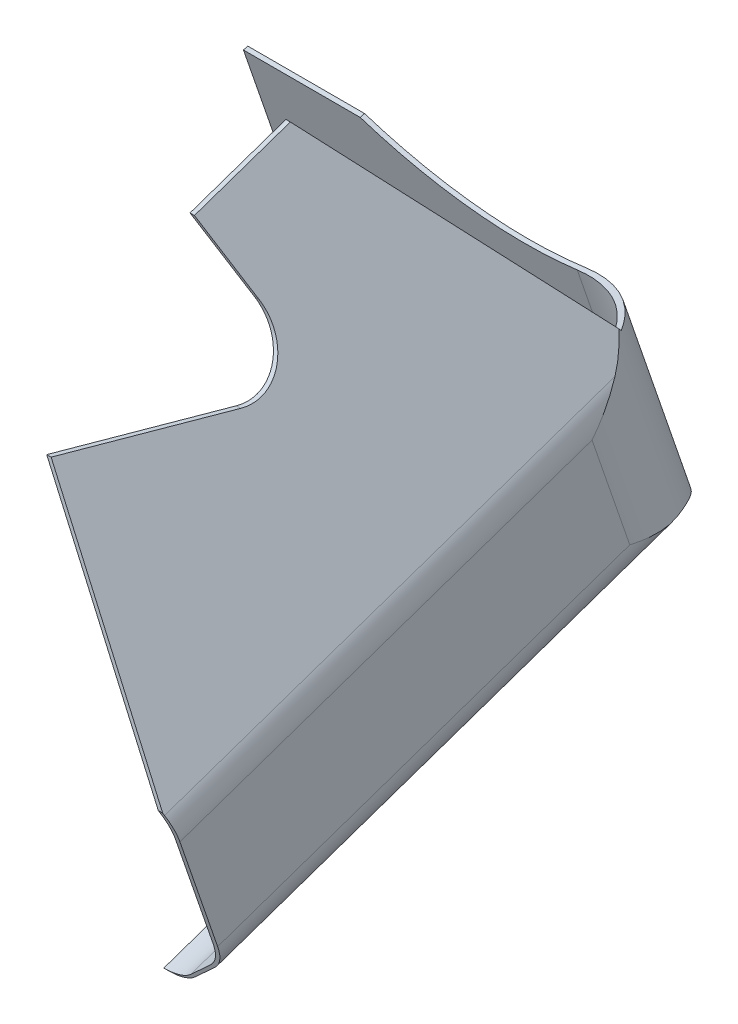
ISO-10303-21;
HEADER;
FILE_DESCRIPTION(('STEP AP214'),'2;1');
FILE_NAME('part.step','',(''),(''),'','','');
FILE_SCHEMA(('AUTOMOTIVE_DESIGN { 1 0 10303 214 1 1 1 1 }'));
ENDSEC;
DATA;
#1=APPLICATION_CONTEXT('core data for automotive mechanical design processes');
#2=APPLICATION_PROTOCOL_DEFINITION('international standard','automotive_design',2000,#1);
#3=PRODUCT_CONTEXT('',#1,'mechanical');
#4=PRODUCT('Part','Part','',(#3));
#5=PRODUCT_RELATED_PRODUCT_CATEGORY('part','',(#4));
#6=PRODUCT_DEFINITION_FORMATION('','',#4);
#7=PRODUCT_DEFINITION_CONTEXT('part definition',#1,'design');
#8=PRODUCT_DEFINITION('design','',#6,#7);
#9=PRODUCT_DEFINITION_SHAPE('','',#8);
#10=(LENGTH_UNIT() NAMED_UNIT(*) SI_UNIT(.MILLI.,.METRE.));
#11=(NAMED_UNIT(*) PLANE_ANGLE_UNIT() SI_UNIT($,.RADIAN.));
#12=(NAMED_UNIT(*) SI_UNIT($,.STERADIAN.) SOLID_ANGLE_UNIT());
#13=UNCERTAINTY_MEASURE_WITH_UNIT(LENGTH_MEASURE(1.E-05),#10,'distance_accuracy_value','');
#14=(GEOMETRIC_REPRESENTATION_CONTEXT(3) GLOBAL_UNCERTAINTY_ASSIGNED_CONTEXT((#13)) GLOBAL_UNIT_ASSIGNED_CONTEXT((#10,
#11,#12)) REPRESENTATION_CONTEXT('',''));
#15=CARTESIAN_POINT('',(0.,0.,0.));
#16=DIRECTION('',(0.,0.,1.));
#17=DIRECTION('',(1.,0.,0.));
#18=AXIS2_PLACEMENT_3D('',#15,#16,#17);
#19=CARTESIAN_POINT('',(-686.667223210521,-391.051832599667,-500.893879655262));
#20=DIRECTION('',(0.707106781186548,-0.668582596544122,-0.230211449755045));
#21=DIRECTION('',(0.687035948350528,0.726623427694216,0.));
#22=AXIS2_PLACEMENT_3D('',#19,#20,#21);
#23=PLANE('',#22);
#24=CARTESIAN_POINT('',(-711.749723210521,-399.676090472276,-552.88945646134));
#25=DIRECTION('',(0.707106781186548,-0.668582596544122,-0.230211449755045));
#26=DIRECTION('',(-0.707106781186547,-0.668582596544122,-0.230211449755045));
#27=AXIS2_PLACEMENT_3D('',#24,#25,#26);
#28=ELLIPSE('',#27,46.6973318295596,33.02);
#29=CARTESIAN_POINT('',(-682.449467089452,-367.015221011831,-557.746204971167));
#30=VERTEX_POINT('',#29);
#31=CARTESIAN_POINT('',(-690.884979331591,-371.615941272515,-570.294870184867));
#32=VERTEX_POINT('',#31);
#33=EDGE_CURVE('E244',#30,#32,#28,.F.);
#34=ORIENTED_EDGE('',*,*,#33,.T.);
#35=DIRECTION('',(0.,0.325568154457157,-0.945518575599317));
#36=VECTOR('',#35,1.);
#37=CARTESIAN_POINT('',(-690.884979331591,-420.468300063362,-428.417318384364));
#38=LINE('',#37,#36);
#39=CARTESIAN_POINT('',(-690.88497933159,-420.468300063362,-428.417318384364));
#40=VERTEX_POINT('',#39);
#41=EDGE_CURVE('E199',#32,#40,#38,.F.);
#42=ORIENTED_EDGE('',*,*,#41,.T.);
#43=DIRECTION('',(0.707106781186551,0.668582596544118,0.230211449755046));
#44=VECTOR('',#43,1.);
#45=CARTESIAN_POINT('',(-690.88497933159,-420.468300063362,-428.417318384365));
#46=LINE('',#45,#44);
#47=CARTESIAN_POINT('',(-682.449467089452,-412.492366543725,-425.670984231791));
#48=VERTEX_POINT('',#47);
#49=EDGE_CURVE('E239',#40,#48,#46,.T.);
#50=ORIENTED_EDGE('',*,*,#49,.T.);
#51=DIRECTION('',(0.,-0.325568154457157,0.945518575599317));
#52=VECTOR('',#51,1.);
#53=CARTESIAN_POINT('',(-682.449467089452,-369.131303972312,-551.600653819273));
#54=LINE('',#53,#52);
#55=EDGE_CURVE('E313',#48,#30,#54,.F.);
#56=ORIENTED_EDGE('',*,*,#55,.T.);
#57=EDGE_LOOP('',(#34,#42,#50,#56));
#58=FACE_BOUND('',#57,.T.);
#59=ADVANCED_FACE('F17',(#58),#23,.F.);
#60=CARTESIAN_POINT('',(-691.429723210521,-360.640304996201,-548.676968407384));
#61=DIRECTION('',(0.,-0.325568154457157,0.945518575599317));
#62=DIRECTION('',(0.,-0.945518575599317,-0.325568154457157));
#63=AXIS2_PLACEMENT_3D('',#60,#61,#62);
#64=CYLINDRICAL_SURFACE('',#63,12.7000000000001);
#65=DIRECTION('',(0.,-0.325568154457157,0.945518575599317));
#66=VECTOR('',#65,1.);
#67=CARTESIAN_POINT('',(-678.729723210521,-363.481155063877,-540.426540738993));
#68=LINE('',#67,#66);
#69=CARTESIAN_POINT('',(-678.729723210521,-363.481155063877,-540.426540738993));
#70=VERTEX_POINT('',#69);
#71=CARTESIAN_POINT('',(-678.729723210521,-404.001367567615,-422.747298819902));
#72=VERTEX_POINT('',#71);
#73=EDGE_CURVE('E309',#70,#72,#68,.T.);
#74=ORIENTED_EDGE('',*,*,#73,.F.);
#75=CARTESIAN_POINT('',(-678.729723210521,-363.481155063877,-540.426540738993));
#76=CARTESIAN_POINT('',(-678.729723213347,-363.483840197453,-540.438353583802));
#77=CARTESIAN_POINT('',(-678.729728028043,-363.486525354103,-540.450166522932));
#78=CARTESIAN_POINT('',(-678.730972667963,-363.83368459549,-541.977441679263));
#79=CARTESIAN_POINT('',(-678.811405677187,-364.178472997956,-543.494384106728));
#80=CARTESIAN_POINT('',(-679.052099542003,-364.683751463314,-545.759108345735));
#81=CARTESIAN_POINT('',(-679.152438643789,-364.850294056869,-546.512702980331));
#82=CARTESIAN_POINT('',(-679.393776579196,-365.177355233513,-548.01480139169));
#83=CARTESIAN_POINT('',(-679.534773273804,-365.337874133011,-548.763305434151));
#84=CARTESIAN_POINT('',(-679.849448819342,-365.642158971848,-550.21305299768));
#85=CARTESIAN_POINT('',(-680.020965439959,-365.786361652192,-550.91467553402));
#86=CARTESIAN_POINT('',(-680.401793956,-366.065105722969,-552.309466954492));
#87=CARTESIAN_POINT('',(-680.61110107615,-366.199648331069,-553.00263689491));
#88=CARTESIAN_POINT('',(-681.068545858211,-366.456685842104,-554.378696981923));
#89=CARTESIAN_POINT('',(-681.316697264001,-366.579176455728,-555.061583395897));
#90=CARTESIAN_POINT('',(-681.718787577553,-366.751699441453,-556.076085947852));
#91=CARTESIAN_POINT('',(-681.857836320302,-366.807351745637,-556.412704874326));
#92=CARTESIAN_POINT('',(-682.146037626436,-366.914503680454,-557.082288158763));
#93=CARTESIAN_POINT('',(-682.295190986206,-366.966002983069,-557.415252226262));
#94=CARTESIAN_POINT('',(-682.449467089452,-367.015221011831,-557.746204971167));
#95=B_SPLINE_CURVE_WITH_KNOTS('',3,(#75,#76,#77,#78,#79,#80,#81,#82,#83,#84,#85,#86,#87,#88,#89,
#90,#91,#92,#93,#94),.UNSPECIFIED.,.F.,.F.,(4,2,2,2,2,2,2,2,2,4),(0.,0.036342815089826,
4.6986660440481,7.03275005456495,9.3667112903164,11.5753091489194,13.7836281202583,
15.9927302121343,17.0978761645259,18.2031093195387),.UNSPECIFIED.);
#96=EDGE_CURVE('E276',#70,#30,#95,.T.);
#97=ORIENTED_EDGE('',*,*,#96,.T.);
#98=ORIENTED_EDGE('',*,*,#55,.F.);
#99=CARTESIAN_POINT('',(-691.429723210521,-404.001367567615,-422.747298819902));
#100=DIRECTION('',(0.,-0.325568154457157,0.945518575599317));
#101=DIRECTION('',(0.,-0.945518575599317,-0.325568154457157));
#102=AXIS2_PLACEMENT_3D('',#99,#100,#101);
#103=CIRCLE('',#102,12.7000000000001);
#104=EDGE_CURVE('E238',#48,#72,#103,.T.);
#105=ORIENTED_EDGE('',*,*,#104,.T.);
#106=EDGE_LOOP('',(#74,#97,#98,#105));
#107=FACE_BOUND('',#106,.T.);
#108=ADVANCED_FACE('F411',(#107),#64,.F.);
#109=CARTESIAN_POINT('',(-678.729723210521,-334.914030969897,-481.564084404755));
#110=DIRECTION('',(-1.,0.,0.));
#111=DIRECTION('',(0.,-1.,0.));
#112=AXIS2_PLACEMENT_3D('',#109,#110,#111);
#113=PLANE('',#112);
#114=ORIENTED_EDGE('',*,*,#73,.T.);
#115=DIRECTION('',(0.,0.945518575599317,0.325568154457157));
#116=VECTOR('',#115,1.);
#117=CARTESIAN_POINT('',(-678.729723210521,-360.342531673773,-407.71435605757));
#118=LINE('',#117,#116);
#119=CARTESIAN_POINT('',(-678.729723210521,-372.383947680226,-411.8605480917));
#120=VERTEX_POINT('',#119);
#121=EDGE_CURVE('E235',#72,#120,#118,.T.);
#122=ORIENTED_EDGE('',*,*,#121,.T.);
#123=DIRECTION('',(0.,0.325568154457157,-0.945518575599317));
#124=VECTOR('',#123,1.);
#125=CARTESIAN_POINT('',(-678.729723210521,-372.383947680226,-411.8605480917));
#126=LINE('',#125,#124);
#127=CARTESIAN_POINT('',(-678.729723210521,-331.863735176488,-529.539790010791));
#128=VERTEX_POINT('',#127);
#129=EDGE_CURVE('E203',#120,#128,#126,.T.);
#130=ORIENTED_EDGE('',*,*,#129,.T.);
#131=DIRECTION('',(0.,-0.945518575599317,-0.325568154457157));
#132=VECTOR('',#131,1.);
#133=CARTESIAN_POINT('',(-678.729723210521,-318.714892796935,-525.012280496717));
#134=LINE('',#133,#132);
#135=EDGE_CURVE('E273',#128,#70,#134,.T.);
#136=ORIENTED_EDGE('',*,*,#135,.T.);
#137=EDGE_LOOP('',(#114,#122,#130,#136));
#138=FACE_BOUND('',#137,.T.);
#139=ADVANCED_FACE('F415',(#138),#113,.T.);
#140=CARTESIAN_POINT('',(-699.865235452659,-411.977301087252,-425.493632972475));
#141=DIRECTION('',(0.,0.325568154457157,-0.945518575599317));
#142=DIRECTION('',(0.,0.945518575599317,0.325568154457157));
#143=AXIS2_PLACEMENT_3D('',#140,#141,#142);
#144=CYLINDRICAL_SURFACE('',#143,12.7);
#145=ORIENTED_EDGE('',*,*,#41,.F.);
#146=CARTESIAN_POINT('',(-690.884979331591,-371.615941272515,-570.294870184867));
#147=CARTESIAN_POINT('',(-691.034159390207,-371.717386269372,-570.458432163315));
#148=CARTESIAN_POINT('',(-691.18676480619,-371.814862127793,-570.621278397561));
#149=CARTESIAN_POINT('',(-691.498680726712,-372.00198041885,-570.945040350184));
#150=CARTESIAN_POINT('',(-691.657991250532,-372.091622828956,-571.105956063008));
#151=CARTESIAN_POINT('',(-692.14577839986,-372.348965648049,-571.585074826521));
#152=CARTESIAN_POINT('',(-692.484094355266,-372.505070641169,-571.899631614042));
#153=CARTESIAN_POINT('',(-693.17428195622,-372.781828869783,-572.505068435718));
#154=CARTESIAN_POINT('',(-693.525389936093,-372.903444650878,-572.796382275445));
#155=CARTESIAN_POINT('',(-694.249370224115,-373.117033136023,-573.362411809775));
#156=CARTESIAN_POINT('',(-694.622241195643,-373.209007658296,-573.637128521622));
#157=CARTESIAN_POINT('',(-695.372558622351,-373.359139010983,-574.155721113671));
#158=CARTESIAN_POINT('',(-695.749207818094,-373.41851486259,-574.400395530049));
#159=CARTESIAN_POINT('',(-696.518976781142,-373.507704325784,-574.868066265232));
#160=CARTESIAN_POINT('',(-696.91209149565,-373.537526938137,-575.091069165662));
#161=CARTESIAN_POINT('',(-697.724903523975,-373.566573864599,-575.51899317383));
#162=CARTESIAN_POINT('',(-698.145046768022,-373.564825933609,-575.723144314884));
#163=CARTESIAN_POINT('',(-698.784021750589,-373.536175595,-576.007453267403));
#164=CARTESIAN_POINT('',(-698.998643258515,-373.52226650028,-576.098632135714));
#165=CARTESIAN_POINT('',(-699.430273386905,-373.48554223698,-576.273311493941));
#166=CARTESIAN_POINT('',(-699.647282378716,-373.462725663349,-576.35681076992));
#167=CARTESIAN_POINT('',(-699.86523545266,-373.435353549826,-576.436305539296));
#168=B_SPLINE_CURVE_WITH_KNOTS('',3,(#146,#147,#148,#149,#150,#151,#152,#153,#154,#155,#156,
#157,#158,#159,#160,#161,#162,#163,#164,#165,#166,#167),.UNSPECIFIED.,.F.,.F.,(4,2,2,2,2,2,2,2,
2,2,4),(0.,0.730410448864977,1.46082299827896,2.92172749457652,4.33657297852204,
5.75133165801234,7.10877834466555,8.46581147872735,9.86470510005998,10.5652391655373,
11.265883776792),.UNSPECIFIED.);
#169=CARTESIAN_POINT('',(-699.86523545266,-373.435353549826,-576.436305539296));
#170=VERTEX_POINT('',#169);
#171=EDGE_CURVE('E20',#32,#170,#168,.T.);
#172=ORIENTED_EDGE('',*,*,#171,.T.);
#173=DIRECTION('',(0.,-0.325568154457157,0.945518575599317));
#174=VECTOR('',#173,1.);
#175=CARTESIAN_POINT('',(-699.86523545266,-398.143414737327,-504.678885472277));
#176=LINE('',#175,#174);
#177=CARTESIAN_POINT('',(-699.86523545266,-423.985386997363,-429.628348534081));
#178=VERTEX_POINT('',#177);
#179=EDGE_CURVE('E197',#170,#178,#176,.T.);
#180=ORIENTED_EDGE('',*,*,#179,.T.);
#181=CARTESIAN_POINT('',(-699.865235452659,-411.977301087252,-425.493632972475));
#182=DIRECTION('',(0.,0.325568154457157,-0.945518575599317));
#183=DIRECTION('',(0.,0.945518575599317,0.325568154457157));
#184=AXIS2_PLACEMENT_3D('',#181,#182,#183);
#185=CIRCLE('',#184,12.7);
#186=EDGE_CURVE('E241',#178,#40,#185,.F.);
#187=ORIENTED_EDGE('',*,*,#186,.T.);
#188=EDGE_LOOP('',(#145,#172,#180,#187));
#189=FACE_BOUND('',#188,.T.);
#190=ADVANCED_FACE('F194',(#189),#144,.F.);
#191=CARTESIAN_POINT('',(-804.459723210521,-334.500559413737,-482.764892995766));
#192=DIRECTION('',(1.,0.,0.));
#193=DIRECTION('',(0.,0.,-1.));
#194=AXIS2_PLACEMENT_3D('',#191,#192,#193);
#195=PLANE('',#194);
#196=DIRECTION('',(0.,-0.325568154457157,0.945518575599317));
#197=VECTOR('',#196,1.);
#198=CARTESIAN_POINT('',(-804.459723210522,-398.143414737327,-504.678885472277));
#199=LINE('',#198,#197);
#200=CARTESIAN_POINT('',(-804.459723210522,-372.30144247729,-579.729422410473));
#201=VERTEX_POINT('',#200);
#202=CARTESIAN_POINT('',(-804.459723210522,-372.71491403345,-578.528613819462));
#203=VERTEX_POINT('',#202);
#204=EDGE_CURVE('E300',#201,#203,#199,.T.);
#205=ORIENTED_EDGE('',*,*,#204,.T.);
#206=DIRECTION('',(0.,0.945518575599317,0.325568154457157));
#207=VECTOR('',#206,1.);
#208=CARTESIAN_POINT('',(-804.459723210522,-309.07205870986,-556.614621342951));
#209=LINE('',#208,#207);
#210=CARTESIAN_POINT('',(-804.459723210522,-310.730562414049,-557.185689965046));
#211=VERTEX_POINT('',#210);
#212=EDGE_CURVE('E281',#203,#211,#209,.T.);
#213=ORIENTED_EDGE('',*,*,#212,.T.);
#214=DIRECTION('',(0.,0.310712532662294,-0.950503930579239));
#215=VECTOR('',#214,1.);
#216=CARTESIAN_POINT('',(-804.459723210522,-306.936207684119,-568.793039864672));
#217=LINE('',#216,#215);
#218=CARTESIAN_POINT('',(-804.459723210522,-310.33590904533,-558.392978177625));
#219=VERTEX_POINT('',#218);
#220=EDGE_CURVE('E285',#211,#219,#217,.T.);
#221=ORIENTED_EDGE('',*,*,#220,.T.);
#222=DIRECTION('',(0.,0.945518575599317,0.325568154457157));
#223=VECTOR('',#222,1.);
#224=CARTESIAN_POINT('',(-804.459723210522,-308.6585871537,-557.815429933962));
#225=LINE('',#224,#223);
#226=EDGE_CURVE('E294',#201,#219,#225,.T.);
#227=ORIENTED_EDGE('',*,*,#226,.F.);
#228=EDGE_LOOP('',(#205,#213,#221,#227));
#229=FACE_BOUND('',#228,.T.);
#230=ADVANCED_FACE('F422',(#229),#195,.F.);
#231=CARTESIAN_POINT('',(-847.312595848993,-306.936207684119,-568.793039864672));
#232=DIRECTION('',(0.,-0.950503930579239,-0.310712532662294));
#233=DIRECTION('',(0.,0.310712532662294,-0.950503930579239));
#234=AXIS2_PLACEMENT_3D('',#231,#232,#233);
#235=PLANE('',#234);
#236=ORIENTED_EDGE('',*,*,#220,.F.);
#237=DIRECTION('',(1.,0.,0.));
#238=VECTOR('',#237,1.);
#239=CARTESIAN_POINT('',(-742.229723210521,-310.730562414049,-557.185689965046));
#240=LINE('',#239,#238);
#241=CARTESIAN_POINT('',(-770.765184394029,-310.730562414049,-557.185689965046));
#242=VERTEX_POINT('',#241);
#243=EDGE_CURVE('E282',#211,#242,#240,.T.);
#244=ORIENTED_EDGE('',*,*,#243,.T.);
#245=DIRECTION('',(-0.0249932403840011,-0.310615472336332,0.950207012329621));
#246=VECTOR('',#245,1.);
#247=CARTESIAN_POINT('',(-770.733429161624,-310.335909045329,-558.392978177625));
#248=LINE('',#247,#246);
#249=CARTESIAN_POINT('',(-770.733429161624,-310.335909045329,-558.392978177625));
#250=VERTEX_POINT('',#249);
#251=EDGE_CURVE('E288',#250,#242,#248,.T.);
#252=ORIENTED_EDGE('',*,*,#251,.F.);
#253=DIRECTION('',(1.,0.,0.));
#254=VECTOR('',#253,1.);
#255=CARTESIAN_POINT('',(-740.959723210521,-310.33590904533,-558.392978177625));
#256=LINE('',#255,#254);
#257=EDGE_CURVE('E297',#219,#250,#256,.T.);
#258=ORIENTED_EDGE('',*,*,#257,.F.);
#259=EDGE_LOOP('',(#236,#244,#252,#258));
#260=FACE_BOUND('',#259,.T.);
#261=ADVANCED_FACE('F425',(#260),#235,.F.);
#262=CARTESIAN_POINT('',(-742.229723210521,-309.07205870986,-556.614621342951));
#263=DIRECTION('',(0.,0.325568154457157,-0.945518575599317));
#264=DIRECTION('',(0.,0.945518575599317,0.325568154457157));
#265=AXIS2_PLACEMENT_3D('',#262,#263,#264);
#266=PLANE('',#265);
#267=DIRECTION('',(1.,0.,0.));
#268=VECTOR('',#267,1.);
#269=CARTESIAN_POINT('',(-740.959723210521,-372.71491403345,-578.528613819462));
#270=LINE('',#269,#268);
#271=CARTESIAN_POINT('',(-711.749723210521,-372.71491403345,-578.528613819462));
#272=VERTEX_POINT('',#271);
#273=EDGE_CURVE('E212',#203,#272,#270,.T.);
#274=ORIENTED_EDGE('',*,*,#273,.T.);
#275=DIRECTION('',(0.,-0.945518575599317,-0.325568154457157));
#276=VECTOR('',#275,1.);
#277=CARTESIAN_POINT('',(-711.749723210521,-307.964632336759,-556.233303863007));
#278=LINE('',#277,#276);
#279=CARTESIAN_POINT('',(-711.749723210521,-321.087832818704,-560.751984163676));
#280=VERTEX_POINT('',#279);
#281=EDGE_CURVE('E202',#272,#280,#278,.F.);
#282=ORIENTED_EDGE('',*,*,#281,.T.);
#283=CARTESIAN_POINT('',(-727.406587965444,-245.352614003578,-534.674257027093));
#284=DIRECTION('',(0.,0.325568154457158,-0.945518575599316));
#285=DIRECTION('',(0.,0.945518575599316,0.325568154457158));
#286=AXIS2_PLACEMENT_3D('',#283,#284,#285);
#287=CIRCLE('',#286,81.6150025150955);
#288=EDGE_CURVE('E385',#280,#242,#287,.T.);
#289=ORIENTED_EDGE('',*,*,#288,.T.);
#290=ORIENTED_EDGE('',*,*,#243,.F.);
#291=ORIENTED_EDGE('',*,*,#212,.F.);
#292=EDGE_LOOP('',(#274,#282,#289,#290,#291));
#293=FACE_BOUND('',#292,.T.);
#294=ADVANCED_FACE('F428',(#293),#266,.F.);
#295=CARTESIAN_POINT('',(-691.429723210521,-372.383947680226,-411.8605480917));
#296=DIRECTION('',(0.,0.325568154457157,-0.945518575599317));
#297=DIRECTION('',(0.,0.945518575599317,0.325568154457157));
#298=AXIS2_PLACEMENT_3D('',#295,#296,#297);
#299=CYLINDRICAL_SURFACE('',#298,12.6999999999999);
#300=DIRECTION('',(0.,0.325568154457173,-0.945518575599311));
#301=VECTOR('',#300,1.);
#302=CARTESIAN_POINT('',(-680.862684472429,-365.7230600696,-409.567020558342));
#303=LINE('',#302,#301);
#304=CARTESIAN_POINT('',(-680.86268447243,-365.723060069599,-409.567020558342));
#305=VERTEX_POINT('',#304);
#306=CARTESIAN_POINT('',(-680.862684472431,-321.40176110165,-538.285419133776));
#307=VERTEX_POINT('',#306);
#308=EDGE_CURVE('E266',#305,#307,#303,.T.);
#309=ORIENTED_EDGE('',*,*,#308,.T.);
#310=CARTESIAN_POINT('',(-680.862684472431,-321.40176110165,-538.285419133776));
#311=CARTESIAN_POINT('',(-680.685288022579,-321.806197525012,-537.928293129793));
#312=CARTESIAN_POINT('',(-680.519412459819,-322.215398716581,-537.570910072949));
#313=CARTESIAN_POINT('',(-680.210330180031,-323.041857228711,-536.855763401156));
#314=CARTESIAN_POINT('',(-680.067120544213,-323.459113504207,-536.49799984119));
#315=CARTESIAN_POINT('',(-679.802924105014,-324.300401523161,-535.782058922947));
#316=CARTESIAN_POINT('',(-679.681941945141,-324.724434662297,-535.423881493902));
#317=CARTESIAN_POINT('',(-679.461917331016,-325.577922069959,-534.707270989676));
#318=CARTESIAN_POINT('',(-679.362875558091,-326.007376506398,-534.348837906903));
#319=CARTESIAN_POINT('',(-679.093201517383,-327.326742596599,-533.252775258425));
#320=CARTESIAN_POINT('',(-678.957524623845,-328.223640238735,-532.514717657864));
#321=CARTESIAN_POINT('',(-678.776283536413,-330.025654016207,-531.038598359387));
#322=CARTESIAN_POINT('',(-678.730665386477,-330.930764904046,-530.300536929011));
#323=CARTESIAN_POINT('',(-678.729728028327,-331.844957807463,-529.5551011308));
#324=CARTESIAN_POINT('',(-678.729723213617,-331.854346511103,-529.547445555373));
#325=CARTESIAN_POINT('',(-678.729723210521,-331.863735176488,-529.539790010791));
#326=B_SPLINE_CURVE_WITH_KNOTS('',3,(#310,#311,#312,#313,#314,#315,#316,#317,#318,#319,#320,
#321,#322,#323,#324,#325),.UNSPECIFIED.,.F.,.F.,(4,2,2,2,2,2,2,4),(0.,1.70367414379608,
3.40712871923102,5.11093875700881,6.81480169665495,10.3193040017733,13.8217060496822,
13.8580488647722),.UNSPECIFIED.);
#327=EDGE_CURVE('E277',#307,#128,#326,.T.);
#328=ORIENTED_EDGE('',*,*,#327,.T.);
#329=ORIENTED_EDGE('',*,*,#129,.F.);
#330=CARTESIAN_POINT('',(-691.429723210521,-372.383947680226,-411.8605480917));
#331=DIRECTION('',(0.,0.325568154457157,-0.945518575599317));
#332=DIRECTION('',(0.,0.945518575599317,0.325568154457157));
#333=AXIS2_PLACEMENT_3D('',#330,#331,#332);
#334=CIRCLE('',#333,12.6999999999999);
#335=EDGE_CURVE('E237',#120,#305,#334,.F.);
#336=ORIENTED_EDGE('',*,*,#335,.T.);
#337=EDGE_LOOP('',(#309,#328,#329,#336));
#338=FACE_BOUND('',#337,.T.);
#339=ADVANCED_FACE('F393',(#338),#299,.F.);
#340=CARTESIAN_POINT('',(-711.749723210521,-318.714892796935,-525.012280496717));
#341=DIRECTION('',(0.,-0.945518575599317,-0.325568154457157));
#342=DIRECTION('',(0.,0.325568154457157,-0.945518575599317));
#343=AXIS2_PLACEMENT_3D('',#340,#341,#342);
#344=CYLINDRICAL_SURFACE('',#343,33.02);
#345=ORIENTED_EDGE('',*,*,#96,.F.);
#346=ORIENTED_EDGE('',*,*,#135,.F.);
#347=ORIENTED_EDGE('',*,*,#327,.F.);
#348=CARTESIAN_POINT('',(-711.749723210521,-281.396444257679,-512.162508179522));
#349=DIRECTION('',(0.832050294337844,0.52447933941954,0.180592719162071));
#350=DIRECTION('',(0.554700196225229,-0.78671900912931,-0.270889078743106));
#351=AXIS2_PLACEMENT_3D('',#348,#349,#350);
#352=ELLIPSE('',#351,59.5276515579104,33.02);
#353=CARTESIAN_POINT('',(-685.189590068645,-312.678982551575,-543.682724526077));
#354=VERTEX_POINT('',#353);
#355=EDGE_CURVE('E509',#307,#354,#352,.T.);
#356=ORIENTED_EDGE('',*,*,#355,.T.);
#357=CARTESIAN_POINT('',(-711.749723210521,-276.686735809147,-510.540825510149));
#358=DIRECTION('',(0.,-0.677377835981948,0.735635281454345));
#359=DIRECTION('',(0.,-0.735635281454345,-0.677377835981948));
#360=AXIS2_PLACEMENT_3D('',#357,#358,#359);
#361=ELLIPSE('',#360,82.3494983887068,33.02);
#362=CARTESIAN_POINT('',(-685.226612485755,-312.770757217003,-543.767231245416));
#363=VERTEX_POINT('',#362);
#364=EDGE_CURVE('E279',#363,#354,#361,.T.);
#365=ORIENTED_EDGE('',*,*,#364,.F.);
#366=CARTESIAN_POINT('',(-711.749723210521,-281.557059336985,-512.217812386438));
#367=DIRECTION('',(0.832049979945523,0.524479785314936,0.180592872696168));
#368=DIRECTION('',(0.554700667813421,-0.786718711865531,-0.270888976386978));
#369=AXIS2_PLACEMENT_3D('',#366,#367,#368);
#370=ELLIPSE('',#369,59.5276009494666,33.02);
#371=CARTESIAN_POINT('',(-683.732699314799,-315.603714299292,-542.422669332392));
#372=VERTEX_POINT('',#371);
#373=EDGE_CURVE('E249',#363,#372,#370,.F.);
#374=ORIENTED_EDGE('',*,*,#373,.T.);
#375=CARTESIAN_POINT('',(-683.732699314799,-315.603714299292,-542.422669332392));
#376=CARTESIAN_POINT('',(-683.995559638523,-315.623948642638,-542.875347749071));
#377=CARTESIAN_POINT('',(-684.267254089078,-315.649754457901,-543.322553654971));
#378=CARTESIAN_POINT('',(-684.827743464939,-315.711580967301,-544.205326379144));
#379=CARTESIAN_POINT('',(-685.116536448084,-315.747600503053,-544.640894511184));
#380=CARTESIAN_POINT('',(-686.007485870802,-315.869553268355,-545.928793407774));
#381=CARTESIAN_POINT('',(-686.634495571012,-315.969404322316,-546.762805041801));
#382=CARTESIAN_POINT('',(-687.952200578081,-316.19962117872,-548.378480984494));
#383=CARTESIAN_POINT('',(-688.643078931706,-316.33007644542,-549.159983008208));
#384=CARTESIAN_POINT('',(-689.722846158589,-316.543763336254,-550.28683084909));
#385=CARTESIAN_POINT('',(-690.090044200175,-316.618000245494,-550.654909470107));
#386=CARTESIAN_POINT('',(-690.838610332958,-316.771790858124,-551.375420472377));
#387=CARTESIAN_POINT('',(-691.219982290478,-316.851346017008,-551.727848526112));
#388=CARTESIAN_POINT('',(-692.384078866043,-317.096824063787,-552.760093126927));
#389=CARTESIAN_POINT('',(-693.187303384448,-317.269664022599,-553.415412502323));
#390=CARTESIAN_POINT('',(-694.844214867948,-317.628644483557,-554.654725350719));
#391=CARTESIAN_POINT('',(-695.697898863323,-317.8147842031,-555.238723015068));
#392=CARTESIAN_POINT('',(-697.011807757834,-318.10031667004,-556.056116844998));
#393=CARTESIAN_POINT('',(-697.454860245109,-318.196444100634,-556.318570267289));
#394=CARTESIAN_POINT('',(-698.351715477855,-318.390350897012,-556.823472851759));
#395=CARTESIAN_POINT('',(-698.805515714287,-318.488129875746,-557.065926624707));
#396=CARTESIAN_POINT('',(-700.182223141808,-318.783230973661,-557.762217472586));
#397=CARTESIAN_POINT('',(-701.120685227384,-318.982371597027,-558.185138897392));
#398=CARTESIAN_POINT('',(-702.846329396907,-319.342941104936,-558.868499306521));
#399=CARTESIAN_POINT('',(-703.627436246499,-319.504171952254,-559.144541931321));
#400=CARTESIAN_POINT('',(-705.208512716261,-319.825798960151,-559.636072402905));
#401=CARTESIAN_POINT('',(-706.008477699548,-319.98619531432,-559.85157497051));
#402=CARTESIAN_POINT('',(-707.626223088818,-320.305409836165,-560.220035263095));
#403=CARTESIAN_POINT('',(-708.444056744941,-320.464220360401,-560.372767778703));
#404=CARTESIAN_POINT('',(-709.678537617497,-320.699999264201,-560.552411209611));
#405=CARTESIAN_POINT('',(-710.091473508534,-320.778214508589,-560.60405972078));
#406=CARTESIAN_POINT('',(-710.919286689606,-320.933731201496,-560.690624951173));
#407=CARTESIAN_POINT('',(-711.334164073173,-321.011032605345,-560.725540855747));
#408=CARTESIAN_POINT('',(-711.749723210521,-321.087832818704,-560.751984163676));
#409=B_SPLINE_CURVE_WITH_KNOTS('',3,(#375,#376,#377,#378,#379,#380,#381,#382,#383,#384,#385,
#386,#387,#388,#389,#390,#391,#392,#393,#394,#395,#396,#397,#398,#399,#400,#401,#402,#403,#404,
#405,#406,#407,#408),.UNSPECIFIED.,.F.,.F.,(4,2,2,2,2,2,2,2,2,2,2,2,2,2,2,2,4),(0.,
1.57127983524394,3.14238153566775,6.28290147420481,9.43271897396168,11.0079032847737,
12.5835204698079,15.7324877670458,18.8812699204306,20.4523766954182,22.0231202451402,
25.1637178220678,27.6935141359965,30.2226947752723,32.760872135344,34.0308988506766,
35.3009873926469),.UNSPECIFIED.);
#410=EDGE_CURVE('E379',#372,#280,#409,.T.);
#411=ORIENTED_EDGE('',*,*,#410,.T.);
#412=ORIENTED_EDGE('',*,*,#281,.F.);
#413=CARTESIAN_POINT('',(-711.749723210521,-383.465174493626,-547.307590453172));
#414=DIRECTION('',(0.,-0.945518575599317,-0.325568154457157));
#415=DIRECTION('',(0.,0.325568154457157,-0.945518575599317));
#416=AXIS2_PLACEMENT_3D('',#413,#414,#415);
#417=CIRCLE('',#416,33.02);
#418=EDGE_CURVE('E206',#272,#170,#417,.T.);
#419=ORIENTED_EDGE('',*,*,#418,.T.);
#420=ORIENTED_EDGE('',*,*,#171,.F.);
#421=ORIENTED_EDGE('',*,*,#33,.F.);
#422=EDGE_LOOP('',(#345,#346,#347,#356,#365,#374,#411,#412,#419,#420,#421));
#423=FACE_BOUND('',#422,.T.);
#424=ADVANCED_FACE('F207',(#423),#344,.F.);
#425=CARTESIAN_POINT('',(-740.959723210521,-360.342531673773,-407.71435605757));
#426=DIRECTION('',(0.,0.325568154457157,-0.945518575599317));
#427=DIRECTION('',(0.,0.945518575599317,0.325568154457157));
#428=AXIS2_PLACEMENT_3D('',#425,#426,#427);
#429=PLANE('',#428);
#430=ORIENTED_EDGE('',*,*,#335,.F.);
#431=ORIENTED_EDGE('',*,*,#121,.F.);
#432=ORIENTED_EDGE('',*,*,#104,.F.);
#433=ORIENTED_EDGE('',*,*,#49,.F.);
#434=ORIENTED_EDGE('',*,*,#186,.F.);
#435=DIRECTION('',(1.,0.,0.));
#436=VECTOR('',#435,1.);
#437=CARTESIAN_POINT('',(-740.959723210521,-423.985386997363,-429.628348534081));
#438=LINE('',#437,#436);
#439=CARTESIAN_POINT('',(-698.59523545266,-423.985386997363,-429.628348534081));
#440=VERTEX_POINT('',#439);
#441=EDGE_CURVE('E217',#178,#440,#438,.T.);
#442=ORIENTED_EDGE('',*,*,#441,.T.);
#443=CARTESIAN_POINT('',(-698.59523545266,-411.977301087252,-425.493632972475));
#444=DIRECTION('',(0.,0.325568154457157,-0.945518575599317));
#445=DIRECTION('',(0.,0.945518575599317,0.325568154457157));
#446=AXIS2_PLACEMENT_3D('',#443,#444,#445);
#447=CIRCLE('',#446,12.7);
#448=CARTESIAN_POINT('',(-689.614979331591,-420.468300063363,-428.417318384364));
#449=VERTEX_POINT('',#448);
#450=EDGE_CURVE('E218',#449,#440,#447,.T.);
#451=ORIENTED_EDGE('',*,*,#450,.F.);
#452=DIRECTION('',(-0.707106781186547,-0.668582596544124,-0.230211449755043));
#453=VECTOR('',#452,1.);
#454=CARTESIAN_POINT('',(-681.179467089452,-412.492366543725,-425.670984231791));
#455=LINE('',#454,#453);
#456=CARTESIAN_POINT('',(-681.179467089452,-412.492366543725,-425.670984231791));
#457=VERTEX_POINT('',#456);
#458=EDGE_CURVE('E230',#457,#449,#455,.T.);
#459=ORIENTED_EDGE('',*,*,#458,.F.);
#460=CARTESIAN_POINT('',(-690.159723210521,-404.001367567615,-422.747298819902));
#461=DIRECTION('',(0.,-0.325568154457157,0.945518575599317));
#462=DIRECTION('',(0.,-0.945518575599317,-0.325568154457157));
#463=AXIS2_PLACEMENT_3D('',#460,#461,#462);
#464=CIRCLE('',#463,12.7000000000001);
#465=CARTESIAN_POINT('',(-677.459723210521,-404.001367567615,-422.747298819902));
#466=VERTEX_POINT('',#465);
#467=EDGE_CURVE('E234',#466,#457,#464,.F.);
#468=ORIENTED_EDGE('',*,*,#467,.F.);
#469=DIRECTION('',(0.,0.945518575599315,0.325568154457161));
#470=VECTOR('',#469,1.);
#471=CARTESIAN_POINT('',(-677.459723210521,-404.001367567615,-422.747298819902));
#472=LINE('',#471,#470);
#473=CARTESIAN_POINT('',(-677.459723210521,-372.383947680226,-411.8605480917));
#474=VERTEX_POINT('',#473);
#475=EDGE_CURVE('E247',#466,#474,#472,.T.);
#476=ORIENTED_EDGE('',*,*,#475,.T.);
#477=CARTESIAN_POINT('',(-690.159723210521,-372.383947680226,-411.8605480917));
#478=DIRECTION('',(0.,0.325568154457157,-0.945518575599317));
#479=DIRECTION('',(0.,0.945518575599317,0.325568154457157));
#480=AXIS2_PLACEMENT_3D('',#477,#478,#479);
#481=CIRCLE('',#480,12.6999999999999);
#482=CARTESIAN_POINT('',(-679.592684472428,-365.723060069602,-409.567020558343));
#483=VERTEX_POINT('',#482);
#484=EDGE_CURVE('E489',#483,#474,#481,.T.);
#485=ORIENTED_EDGE('',*,*,#484,.F.);
#486=DIRECTION('',(0.554700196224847,-0.786719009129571,-0.270889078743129));
#487=VECTOR('',#486,1.);
#488=CARTESIAN_POINT('',(-679.951861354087,-365.213647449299,-409.391615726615));
#489=LINE('',#488,#487);
#490=CARTESIAN_POINT('',(-679.951861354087,-365.213647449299,-409.391615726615));
#491=VERTEX_POINT('',#490);
#492=EDGE_CURVE('E242',#491,#483,#489,.T.);
#493=ORIENTED_EDGE('',*,*,#492,.F.);
#494=DIRECTION('',(1.,0.,0.));
#495=VECTOR('',#494,1.);
#496=CARTESIAN_POINT('',(-847.312595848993,-365.213647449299,-409.391615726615));
#497=LINE('',#496,#495);
#498=CARTESIAN_POINT('',(-681.221861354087,-365.213647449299,-409.391615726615));
#499=VERTEX_POINT('',#498);
#500=EDGE_CURVE('E260',#491,#499,#497,.F.);
#501=ORIENTED_EDGE('',*,*,#500,.T.);
#502=DIRECTION('',(0.554700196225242,-0.786719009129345,-0.270889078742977));
#503=VECTOR('',#502,1.);
#504=CARTESIAN_POINT('',(-681.221861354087,-365.213647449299,-409.391615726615));
#505=LINE('',#504,#503);
#506=EDGE_CURVE('E263',#499,#305,#505,.T.);
#507=ORIENTED_EDGE('',*,*,#506,.T.);
#508=EDGE_LOOP('',(#430,#431,#432,#433,#434,#442,#451,#459,#468,#476,#485,#493,#501,#507));
#509=FACE_BOUND('',#508,.T.);
#510=ADVANCED_FACE('F392',(#509),#429,.F.);
#511=CARTESIAN_POINT('',(-690.159723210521,-357.835406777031,-556.822984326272));
#512=DIRECTION('',(0.,-0.325568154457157,0.945518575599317));
#513=DIRECTION('',(0.,-0.945518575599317,-0.325568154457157));
#514=AXIS2_PLACEMENT_3D('',#511,#512,#513);
#515=CYLINDRICAL_SURFACE('',#514,12.7000000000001);
#516=DIRECTION('',(0.,-0.325568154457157,0.945518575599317));
#517=VECTOR('',#516,1.);
#518=CARTESIAN_POINT('',(-677.459723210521,-363.067683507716,-541.627349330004));
#519=LINE('',#518,#517);
#520=CARTESIAN_POINT('',(-677.459723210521,-363.067683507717,-541.627349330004));
#521=VERTEX_POINT('',#520);
#522=EDGE_CURVE('E250',#521,#466,#519,.T.);
#523=ORIENTED_EDGE('',*,*,#522,.T.);
#524=ORIENTED_EDGE('',*,*,#467,.T.);
#525=DIRECTION('',(-7.19798232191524E-09,-0.325568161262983,0.945518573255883));
#526=VECTOR('',#525,1.);
#527=CARTESIAN_POINT('',(-681.179466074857,-366.601749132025,-558.947011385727));
#528=LINE('',#527,#526);
#529=CARTESIAN_POINT('',(-681.179466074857,-366.601749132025,-558.947011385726));
#530=VERTEX_POINT('',#529);
#531=EDGE_CURVE('E231',#530,#457,#528,.T.);
#532=ORIENTED_EDGE('',*,*,#531,.F.);
#533=CARTESIAN_POINT('',(-681.179466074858,-366.601749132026,-558.947011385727));
#534=CARTESIAN_POINT('',(-680.959096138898,-366.531428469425,-558.474256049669));
#535=CARTESIAN_POINT('',(-680.749162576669,-366.45647381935,-557.997387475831));
#536=CARTESIAN_POINT('',(-680.349813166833,-366.298450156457,-557.036559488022));
#537=CARTESIAN_POINT('',(-680.160393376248,-366.215382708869,-556.5526014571));
#538=CARTESIAN_POINT('',(-679.801739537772,-366.042311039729,-555.578839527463));
#539=CARTESIAN_POINT('',(-679.632493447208,-365.952311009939,-555.089039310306));
#540=CARTESIAN_POINT('',(-679.313692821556,-365.766314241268,-554.104204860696));
#541=CARTESIAN_POINT('',(-679.16413925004,-365.670317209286,-553.609170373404));
#542=CARTESIAN_POINT('',(-678.745651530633,-365.37550031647,-552.121488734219));
#543=CARTESIAN_POINT('',(-678.505387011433,-365.169110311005,-551.122150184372));
#544=CARTESIAN_POINT('',(-678.09947619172,-364.742418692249,-549.111605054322));
#545=CARTESIAN_POINT('',(-677.933821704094,-364.522118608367,-548.100399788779));
#546=CARTESIAN_POINT('',(-677.74740681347,-364.197946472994,-546.635519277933));
#547=CARTESIAN_POINT('',(-677.697309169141,-364.09748919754,-546.184660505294));
#548=CARTESIAN_POINT('',(-677.611401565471,-363.895335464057,-545.281947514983));
#549=CARTESIAN_POINT('',(-677.575589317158,-363.793639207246,-544.830093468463));
#550=CARTESIAN_POINT('',(-677.489489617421,-363.487379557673,-543.473807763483));
#551=CARTESIAN_POINT('',(-677.460475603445,-363.281533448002,-542.568150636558));
#552=CARTESIAN_POINT('',(-677.459728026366,-363.073053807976,-541.650975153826));
#553=CARTESIAN_POINT('',(-677.459723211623,-363.070368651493,-541.639162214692));
#554=CARTESIAN_POINT('',(-677.459723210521,-363.067683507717,-541.627349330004));
#555=B_SPLINE_CURVE_WITH_KNOTS('',3,(#533,#534,#535,#536,#537,#538,#539,#540,#541,#542,#543,
#544,#545,#546,#547,#548,#549,#550,#551,#552,#553,#554),.UNSPECIFIED.,.F.,.F.,(4,2,2,2,2,2,2,2,
2,2,4),(0.,1.57871644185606,3.15712889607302,4.73459434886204,6.31213695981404,9.45393329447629,
12.5953847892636,13.9890639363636,15.3825196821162,18.1678791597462,18.2042219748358),.UNSPECIFIED.);
#556=EDGE_CURVE('E560',#521,#530,#555,.F.);
#557=ORIENTED_EDGE('',*,*,#556,.F.);
#558=EDGE_LOOP('',(#523,#524,#532,#557));
#559=FACE_BOUND('',#558,.T.);
#560=ADVANCED_FACE('F555',(#559),#515,.T.);
#561=CARTESIAN_POINT('',(-685.397223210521,-390.638361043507,-502.094688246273));
#562=DIRECTION('',(0.707106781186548,-0.668582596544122,-0.230211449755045));
#563=DIRECTION('',(0.687035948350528,0.726623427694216,0.));
#564=AXIS2_PLACEMENT_3D('',#561,#562,#563);
#565=PLANE('',#564);
#566=ORIENTED_EDGE('',*,*,#531,.T.);
#567=ORIENTED_EDGE('',*,*,#458,.T.);
#568=DIRECTION('',(0.,0.325568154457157,-0.945518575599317));
#569=VECTOR('',#568,1.);
#570=CARTESIAN_POINT('',(-689.614979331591,-420.468300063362,-428.417318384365));
#571=LINE('',#570,#569);
#572=CARTESIAN_POINT('',(-689.614979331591,-371.202469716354,-571.495678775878));
#573=VERTEX_POINT('',#572);
#574=EDGE_CURVE('E223',#573,#449,#571,.F.);
#575=ORIENTED_EDGE('',*,*,#574,.F.);
#576=CARTESIAN_POINT('',(-710.479723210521,-399.262618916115,-554.090265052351));
#577=DIRECTION('',(0.707106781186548,-0.668582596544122,-0.230211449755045));
#578=DIRECTION('',(-0.707106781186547,-0.668582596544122,-0.230211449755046));
#579=AXIS2_PLACEMENT_3D('',#576,#577,#578);
#580=ELLIPSE('',#579,46.6973318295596,33.02);
#581=EDGE_CURVE('E540',#530,#573,#580,.F.);
#582=ORIENTED_EDGE('',*,*,#581,.F.);
#583=EDGE_LOOP('',(#566,#567,#575,#582));
#584=FACE_BOUND('',#583,.T.);
#585=ADVANCED_FACE('F552',(#584),#565,.T.);
#586=CARTESIAN_POINT('',(-698.59523545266,-411.977301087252,-425.493632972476));
#587=DIRECTION('',(0.,0.325568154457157,-0.945518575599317));
#588=DIRECTION('',(0.,0.945518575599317,0.325568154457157));
#589=AXIS2_PLACEMENT_3D('',#586,#587,#588);
#590=CYLINDRICAL_SURFACE('',#589,12.7);
#591=ORIENTED_EDGE('',*,*,#574,.T.);
#592=ORIENTED_EDGE('',*,*,#450,.T.);
#593=DIRECTION('',(0.,-0.325568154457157,0.945518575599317));
#594=VECTOR('',#593,1.);
#595=CARTESIAN_POINT('',(-698.59523545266,-398.143414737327,-504.678885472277));
#596=LINE('',#595,#594);
#597=CARTESIAN_POINT('',(-698.59523545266,-373.021881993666,-577.637114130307));
#598=VERTEX_POINT('',#597);
#599=EDGE_CURVE('E220',#440,#598,#596,.F.);
#600=ORIENTED_EDGE('',*,*,#599,.T.);
#601=CARTESIAN_POINT('',(-689.614979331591,-371.202469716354,-571.495678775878));
#602=CARTESIAN_POINT('',(-689.784128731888,-371.317489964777,-571.681139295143));
#603=CARTESIAN_POINT('',(-689.957706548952,-371.427428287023,-571.865699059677));
#604=CARTESIAN_POINT('',(-690.313454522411,-371.637248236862,-572.232246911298));
#605=CARTESIAN_POINT('',(-690.495624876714,-371.737129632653,-572.414234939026));
#606=CARTESIAN_POINT('',(-690.868460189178,-371.927026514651,-572.775029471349));
#607=CARTESIAN_POINT('',(-691.059132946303,-372.017032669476,-572.95383283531));
#608=CARTESIAN_POINT('',(-691.448531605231,-372.187068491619,-573.307325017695));
#609=CARTESIAN_POINT('',(-691.647257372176,-372.267098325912,-573.482013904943));
#610=CARTESIAN_POINT('',(-692.240542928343,-372.486750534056,-573.986419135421));
#611=CARTESIAN_POINT('',(-692.645800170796,-372.612807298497,-574.309662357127));
#612=CARTESIAN_POINT('',(-693.483059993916,-372.826564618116,-574.932958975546));
#613=CARTESIAN_POINT('',(-693.915048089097,-372.914285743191,-575.233024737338));
#614=CARTESIAN_POINT('',(-694.685305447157,-373.031683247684,-575.729167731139));
#615=CARTESIAN_POINT('',(-695.018031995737,-373.070584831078,-575.93171276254));
#616=CARTESIAN_POINT('',(-695.695041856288,-373.125846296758,-576.319641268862));
#617=CARTESIAN_POINT('',(-696.039321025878,-373.14221417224,-576.50503080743));
#618=CARTESIAN_POINT('',(-696.747311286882,-373.151553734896,-576.86157180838));
#619=CARTESIAN_POINT('',(-697.111296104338,-373.143880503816,-577.032202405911));
#620=CARTESIAN_POINT('',(-697.663449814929,-373.112941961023,-577.271671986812));
#621=CARTESIAN_POINT('',(-697.848644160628,-373.099376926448,-577.348790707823));
#622=CARTESIAN_POINT('',(-698.220739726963,-373.065627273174,-577.497300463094));
#623=CARTESIAN_POINT('',(-698.407641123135,-373.045441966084,-577.568690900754));
#624=CARTESIAN_POINT('',(-698.59523545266,-373.021881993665,-577.637114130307));
#625=B_SPLINE_CURVE_WITH_KNOTS('',3,(#601,#602,#603,#604,#605,#606,#607,#608,#609,#610,#611,
#612,#613,#614,#615,#616,#617,#618,#619,#620,#621,#622,#623,#624),.UNSPECIFIED.,.F.,.F.,(4,2,2,
2,2,2,2,2,2,2,2,4),(0.,0.828231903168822,1.65648289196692,2.48550989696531,3.31452302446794,
4.91236675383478,6.50935206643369,7.6826426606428,8.85551695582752,10.0601211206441,
10.6631518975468,11.2662453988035),.UNSPECIFIED.);
#626=EDGE_CURVE('E539',#573,#598,#625,.T.);
#627=ORIENTED_EDGE('',*,*,#626,.F.);
#628=EDGE_LOOP('',(#591,#592,#600,#627));
#629=FACE_BOUND('',#628,.T.);
#630=ADVANCED_FACE('F548',(#629),#590,.T.);
#631=CARTESIAN_POINT('',(-740.959723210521,-398.143414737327,-504.678885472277));
#632=DIRECTION('',(0.,0.945518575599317,0.325568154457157));
#633=DIRECTION('',(0.,-0.325568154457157,0.945518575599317));
#634=AXIS2_PLACEMENT_3D('',#631,#632,#633);
#635=PLANE('',#634);
#636=ORIENTED_EDGE('',*,*,#273,.F.);
#637=ORIENTED_EDGE('',*,*,#204,.F.);
#638=DIRECTION('',(1.,0.,0.));
#639=VECTOR('',#638,1.);
#640=CARTESIAN_POINT('',(-740.959723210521,-372.30144247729,-579.729422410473));
#641=LINE('',#640,#639);
#642=CARTESIAN_POINT('',(-710.479723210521,-372.30144247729,-579.729422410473));
#643=VERTEX_POINT('',#642);
#644=EDGE_CURVE('E211',#643,#201,#641,.F.);
#645=ORIENTED_EDGE('',*,*,#644,.F.);
#646=CARTESIAN_POINT('',(-710.479723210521,-383.051702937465,-548.508399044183));
#647=DIRECTION('',(0.,-0.945518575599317,-0.325568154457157));
#648=DIRECTION('',(0.,0.325568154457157,-0.945518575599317));
#649=AXIS2_PLACEMENT_3D('',#646,#647,#648);
#650=CIRCLE('',#649,33.02);
#651=EDGE_CURVE('E486',#598,#643,#650,.F.);
#652=ORIENTED_EDGE('',*,*,#651,.F.);
#653=ORIENTED_EDGE('',*,*,#599,.F.);
#654=ORIENTED_EDGE('',*,*,#441,.F.);
#655=ORIENTED_EDGE('',*,*,#179,.F.);
#656=ORIENTED_EDGE('',*,*,#418,.F.);
#657=EDGE_LOOP('',(#636,#637,#645,#652,#653,#654,#655,#656));
#658=FACE_BOUND('',#657,.T.);
#659=ADVANCED_FACE('F215',(#658),#635,.F.);
#660=CARTESIAN_POINT('',(-740.959723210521,-308.6585871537,-557.815429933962));
#661=DIRECTION('',(0.,0.325568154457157,-0.945518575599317));
#662=DIRECTION('',(0.,0.945518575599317,0.325568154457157));
#663=AXIS2_PLACEMENT_3D('',#660,#661,#662);
#664=PLANE('',#663);
#665=CARTESIAN_POINT('',(-727.406587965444,-244.939142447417,-535.875065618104));
#666=DIRECTION('',(0.,0.325568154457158,-0.945518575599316));
#667=DIRECTION('',(0.,0.945518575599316,0.325568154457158));
#668=AXIS2_PLACEMENT_3D('',#665,#666,#667);
#669=CIRCLE('',#668,81.6150025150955);
#670=CARTESIAN_POINT('',(-710.479723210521,-320.429726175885,-561.868558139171));
#671=VERTEX_POINT('',#670);
#672=EDGE_CURVE('E386',#250,#671,#669,.F.);
#673=ORIENTED_EDGE('',*,*,#672,.T.);
#674=DIRECTION('',(0.,-0.945518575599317,-0.325568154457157));
#675=VECTOR('',#674,1.);
#676=CARTESIAN_POINT('',(-710.479723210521,-308.432069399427,-557.737433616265));
#677=LINE('',#676,#675);
#678=EDGE_CURVE('E483',#643,#671,#677,.F.);
#679=ORIENTED_EDGE('',*,*,#678,.F.);
#680=ORIENTED_EDGE('',*,*,#644,.T.);
#681=ORIENTED_EDGE('',*,*,#226,.T.);
#682=ORIENTED_EDGE('',*,*,#257,.T.);
#683=EDGE_LOOP('',(#673,#679,#680,#681,#682));
#684=FACE_BOUND('',#683,.T.);
#685=ADVANCED_FACE('F374',(#684),#664,.T.);
#686=CARTESIAN_POINT('',(-727.406587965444,-250.446500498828,-519.880536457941));
#687=DIRECTION('',(0.,0.325568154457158,-0.945518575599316));
#688=DIRECTION('',(0.,0.945518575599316,0.325568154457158));
#689=AXIS2_PLACEMENT_3D('',#686,#687,#688);
#690=CYLINDRICAL_SURFACE('',#689,81.6150025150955);
#691=ORIENTED_EDGE('',*,*,#410,.F.);
#692=DIRECTION('',(0.,0.325568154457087,-0.945518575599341));
#693=VECTOR('',#692,1.);
#694=CARTESIAN_POINT('',(-683.732699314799,-315.603714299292,-542.422669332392));
#695=LINE('',#694,#693);
#696=CARTESIAN_POINT('',(-683.732699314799,-314.575560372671,-545.408645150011));
#697=VERTEX_POINT('',#696);
#698=EDGE_CURVE('E267',#372,#697,#695,.T.);
#699=ORIENTED_EDGE('',*,*,#698,.T.);
#700=CARTESIAN_POINT('',(-710.479723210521,-320.429726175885,-561.868558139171));
#701=CARTESIAN_POINT('',(-710.006545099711,-320.334881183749,-561.835909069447));
#702=CARTESIAN_POINT('',(-709.534279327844,-320.23935965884,-561.792252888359));
#703=CARTESIAN_POINT('',(-708.592526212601,-320.047134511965,-561.683298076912));
#704=CARTESIAN_POINT('',(-708.123038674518,-319.95043097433,-561.618000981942));
#705=CARTESIAN_POINT('',(-707.188021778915,-319.756060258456,-561.466179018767));
#706=CARTESIAN_POINT('',(-706.722490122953,-319.658393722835,-561.379667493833));
#707=CARTESIAN_POINT('',(-705.795977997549,-319.462251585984,-561.185850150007));
#708=CARTESIAN_POINT('',(-705.334997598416,-319.363775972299,-561.078544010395));
#709=CARTESIAN_POINT('',(-703.964419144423,-319.06840201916,-560.727237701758));
#710=CARTESIAN_POINT('',(-703.062560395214,-318.870594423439,-560.45309162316));
#711=CARTESIAN_POINT('',(-701.285804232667,-318.474793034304,-559.828463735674));
#712=CARTESIAN_POINT('',(-700.410910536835,-318.27679921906,-559.477971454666));
#713=CARTESIAN_POINT('',(-698.695030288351,-317.88363276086,-558.706144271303));
#714=CARTESIAN_POINT('',(-697.853965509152,-317.68845436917,-558.284986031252));
#715=CARTESIAN_POINT('',(-696.207605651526,-317.303283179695,-557.375842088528));
#716=CARTESIAN_POINT('',(-695.402310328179,-317.113290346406,-556.887856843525));
#717=CARTESIAN_POINT('',(-693.829849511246,-316.741412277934,-555.848852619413));
#718=CARTESIAN_POINT('',(-693.062739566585,-316.559538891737,-555.297745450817));
#719=CARTESIAN_POINT('',(-691.57095519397,-316.207742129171,-554.137430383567));
#720=CARTESIAN_POINT('',(-690.846278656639,-316.037818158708,-553.528225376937));
#721=CARTESIAN_POINT('',(-689.536663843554,-315.735663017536,-552.341505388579));
#722=CARTESIAN_POINT('',(-688.946040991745,-315.601436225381,-551.770750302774));
#723=CARTESIAN_POINT('',(-687.800534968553,-315.347722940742,-550.591484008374));
#724=CARTESIAN_POINT('',(-687.245646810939,-315.228234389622,-549.982978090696));
#725=CARTESIAN_POINT('',(-686.174763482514,-315.007332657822,-548.732288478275));
#726=CARTESIAN_POINT('',(-685.658671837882,-314.905873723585,-548.090195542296));
#727=CARTESIAN_POINT('',(-684.665715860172,-314.72403951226,-546.773293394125));
#728=CARTESIAN_POINT('',(-684.188860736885,-314.643669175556,-546.098476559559));
#729=CARTESIAN_POINT('',(-683.732699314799,-314.575560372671,-545.408645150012));
#730=B_SPLINE_CURVE_WITH_KNOTS('',3,(#700,#701,#702,#703,#704,#705,#706,#707,#708,#709,#710,
#711,#712,#713,#714,#715,#716,#717,#718,#719,#720,#721,#722,#723,#724,#725,#726,#727,#728,#729),
.UNSPECIFIED.,.F.,.F.,(4,2,2,2,2,2,2,2,2,2,2,2,2,2,4),(0.,1.45092650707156,2.90175009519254,
4.35166348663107,5.80159924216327,8.68717098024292,11.5731387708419,14.4519964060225,
17.3308343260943,20.2137445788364,23.0965113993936,25.5915126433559,28.0861649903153,
30.5743933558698,33.0632041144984),.UNSPECIFIED.);
#731=EDGE_CURVE('E333',#671,#697,#730,.T.);
#732=ORIENTED_EDGE('',*,*,#731,.F.);
#733=ORIENTED_EDGE('',*,*,#672,.F.);
#734=ORIENTED_EDGE('',*,*,#251,.T.);
#735=ORIENTED_EDGE('',*,*,#288,.F.);
#736=EDGE_LOOP('',(#691,#699,#732,#733,#734,#735));
#737=FACE_BOUND('',#736,.T.);
#738=ADVANCED_FACE('F369',(#737),#690,.F.);
#739=CARTESIAN_POINT('',(-677.459723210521,-334.500559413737,-482.764892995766));
#740=DIRECTION('',(-1.,0.,0.));
#741=DIRECTION('',(0.,-1.,0.));
#742=AXIS2_PLACEMENT_3D('',#739,#740,#741);
#743=PLANE('',#742);
#744=DIRECTION('',(0.,0.325568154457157,-0.945518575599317));
#745=VECTOR('',#744,1.);
#746=CARTESIAN_POINT('',(-677.459723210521,-372.383947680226,-411.8605480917));
#747=LINE('',#746,#745);
#748=CARTESIAN_POINT('',(-677.459723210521,-331.450263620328,-530.740598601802));
#749=VERTEX_POINT('',#748);
#750=EDGE_CURVE('E487',#474,#749,#747,.T.);
#751=ORIENTED_EDGE('',*,*,#750,.F.);
#752=ORIENTED_EDGE('',*,*,#475,.F.);
#753=ORIENTED_EDGE('',*,*,#522,.F.);
#754=DIRECTION('',(0.,-0.945518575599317,-0.325568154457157));
#755=VECTOR('',#754,1.);
#756=CARTESIAN_POINT('',(-677.459723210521,-319.182329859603,-526.516410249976));
#757=LINE('',#756,#755);
#758=EDGE_CURVE('E331',#749,#521,#757,.T.);
#759=ORIENTED_EDGE('',*,*,#758,.F.);
#760=EDGE_LOOP('',(#751,#752,#753,#759));
#761=FACE_BOUND('',#760,.T.);
#762=ADVANCED_FACE('F366',(#761),#743,.F.);
#763=CARTESIAN_POINT('',(-683.732699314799,-376.698123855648,-364.99162053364));
#764=DIRECTION('',(0.832049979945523,0.524479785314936,0.180592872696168));
#765=DIRECTION('',(-0.533247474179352,0.845959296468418,0.));
#766=AXIS2_PLACEMENT_3D('',#763,#764,#765);
#767=PLANE('',#766);
#768=ORIENTED_EDGE('',*,*,#698,.F.);
#769=ORIENTED_EDGE('',*,*,#373,.F.);
#770=DIRECTION('',(0.521211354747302,-0.627811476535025,-0.578092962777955));
#771=VECTOR('',#770,1.);
#772=CARTESIAN_POINT('',(-685.226612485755,-312.770757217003,-543.767231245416));
#773=LINE('',#772,#771);
#774=CARTESIAN_POINT('',(-683.740763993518,-314.560497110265,-545.415235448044));
#775=VERTEX_POINT('',#774);
#776=EDGE_CURVE('E462',#363,#775,#773,.T.);
#777=ORIENTED_EDGE('',*,*,#776,.T.);
#778=CARTESIAN_POINT('',(-683.732699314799,-314.575560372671,-545.408645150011));
#779=CARTESIAN_POINT('',(-683.73303524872,-314.574932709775,-545.408919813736));
#780=CARTESIAN_POINT('',(-683.733371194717,-314.574305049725,-545.409194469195));
#781=CARTESIAN_POINT('',(-683.734043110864,-314.573049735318,-545.409743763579));
#782=CARTESIAN_POINT('',(-683.734379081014,-314.572422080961,-545.410018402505));
#783=CARTESIAN_POINT('',(-683.735051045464,-314.571166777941,-545.410567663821));
#784=CARTESIAN_POINT('',(-683.735387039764,-314.570539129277,-545.410842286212));
#785=CARTESIAN_POINT('',(-683.736059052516,-314.569283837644,-545.411391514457));
#786=CARTESIAN_POINT('',(-683.736395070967,-314.568656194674,-545.411666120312));
#787=CARTESIAN_POINT('',(-683.737067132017,-314.567400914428,-545.412215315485));
#788=CARTESIAN_POINT('',(-683.737403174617,-314.566773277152,-545.412489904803));
#789=CARTESIAN_POINT('',(-683.738075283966,-314.565518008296,-545.413039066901));
#790=CARTESIAN_POINT('',(-683.738411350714,-314.564890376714,-545.413313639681));
#791=CARTESIAN_POINT('',(-683.739083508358,-314.563635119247,-545.413862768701));
#792=CARTESIAN_POINT('',(-683.739419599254,-314.563007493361,-545.414137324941));
#793=CARTESIAN_POINT('',(-683.740091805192,-314.561752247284,-545.414686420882));
#794=CARTESIAN_POINT('',(-683.740427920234,-314.561124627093,-545.414960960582));
#795=CARTESIAN_POINT('',(-683.740764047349,-314.56049700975,-545.415235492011));
#796=B_SPLINE_CURVE_WITH_KNOTS('',3,(#778,#779,#780,#781,#782,#783,#784,#785,#786,#787,#788,
#789,#790,#791,#792,#793,#794,#795),.UNSPECIFIED.,.F.,.F.,(4,2,2,2,2,2,2,2,4),(0.,
0.00228916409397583,0.00457832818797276,0.00686749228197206,0.00915665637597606,
0.0114458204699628,0.0137349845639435,0.0160241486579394,0.0183133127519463),.UNSPECIFIED.);
#797=EDGE_CURVE('E332',#697,#775,#796,.T.);
#798=ORIENTED_EDGE('',*,*,#797,.F.);
#799=EDGE_LOOP('',(#768,#769,#777,#798));
#800=FACE_BOUND('',#799,.T.);
#801=ADVANCED_FACE('F362',(#800),#767,.F.);
#802=CARTESIAN_POINT('',(-704.129723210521,-307.295433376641,-472.054238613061));
#803=DIRECTION('',(0.832050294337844,0.52447933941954,0.180592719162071));
#804=DIRECTION('',(-0.533247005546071,0.845959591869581,0.));
#805=AXIS2_PLACEMENT_3D('',#802,#803,#804);
#806=PLANE('',#805);
#807=CARTESIAN_POINT('',(-716.993303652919,-290.708941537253,-460.958145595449));
#808=DIRECTION('',(0.832050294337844,0.52447933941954,0.180592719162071));
#809=DIRECTION('',(0.554700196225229,-0.78671900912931,-0.270889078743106));
#810=AXIS2_PLACEMENT_3D('',#807,#808,#809);
#811=ELLIPSE('',#810,15.2635003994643,12.7);
#812=CARTESIAN_POINT('',(-709.242007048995,-303.365833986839,-459.912644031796));
#813=VERTEX_POINT('',#812);
#814=CARTESIAN_POINT('',(-716.993303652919,-286.574225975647,-472.966231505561));
#815=VERTEX_POINT('',#814);
#816=EDGE_CURVE('E254',#813,#815,#811,.T.);
#817=ORIENTED_EDGE('',*,*,#816,.T.);
#818=DIRECTION('',(-0.554700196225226,0.78671900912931,0.270889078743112));
#819=VECTOR('',#818,1.);
#820=CARTESIAN_POINT('',(-716.993303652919,-286.574225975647,-472.966231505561));
#821=LINE('',#820,#819);
#822=CARTESIAN_POINT('',(-729.529723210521,-268.794099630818,-466.844043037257));
#823=VERTEX_POINT('',#822);
#824=EDGE_CURVE('E502',#815,#823,#821,.T.);
#825=ORIENTED_EDGE('',*,*,#824,.T.);
#826=DIRECTION('',(0.,0.325568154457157,-0.945518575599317));
#827=VECTOR('',#826,1.);
#828=CARTESIAN_POINT('',(-729.529723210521,-270.857704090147,-460.850900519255));
#829=LINE('',#828,#827);
#830=CARTESIAN_POINT('',(-729.529723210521,-259.270171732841,-494.503538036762));
#831=VERTEX_POINT('',#830);
#832=EDGE_CURVE('E466',#823,#831,#829,.T.);
#833=ORIENTED_EDGE('',*,*,#832,.T.);
#834=DIRECTION('',(0.521210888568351,-0.627811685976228,-0.578093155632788));
#835=VECTOR('',#834,1.);
#836=CARTESIAN_POINT('',(-729.529723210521,-259.270171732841,-494.503538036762));
#837=LINE('',#836,#835);
#838=EDGE_CURVE('E470',#831,#354,#837,.T.);
#839=ORIENTED_EDGE('',*,*,#838,.T.);
#840=ORIENTED_EDGE('',*,*,#355,.F.);
#841=ORIENTED_EDGE('',*,*,#308,.F.);
#842=ORIENTED_EDGE('',*,*,#506,.F.);
#843=DIRECTION('',(-0.515651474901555,0.851328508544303,-0.096660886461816));
#844=VECTOR('',#843,1.);
#845=CARTESIAN_POINT('',(-681.221861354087,-365.213647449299,-409.391615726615));
#846=LINE('',#845,#844);
#847=CARTESIAN_POINT('',(-720.839363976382,-299.806078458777,-416.818071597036));
#848=VERTEX_POINT('',#847);
#849=EDGE_CURVE('E257',#499,#848,#846,.T.);
#850=ORIENTED_EDGE('',*,*,#849,.T.);
#851=DIRECTION('',(0.259045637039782,-0.0795128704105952,-0.962586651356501));
#852=VECTOR('',#851,1.);
#853=CARTESIAN_POINT('',(-720.839363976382,-299.806078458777,-416.818071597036));
#854=LINE('',#853,#852);
#855=EDGE_CURVE('E251',#848,#813,#854,.T.);
#856=ORIENTED_EDGE('',*,*,#855,.T.);
#857=EDGE_LOOP('',(#817,#825,#833,#839,#840,#841,#842,#850,#856));
#858=FACE_BOUND('',#857,.T.);
#859=ADVANCED_FACE('F358',(#858),#806,.F.);
#860=CARTESIAN_POINT('',(-709.919736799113,-290.708941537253,-460.958145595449));
#861=DIRECTION('',(1.,0.,0.));
#862=DIRECTION('',(0.,0.,-1.));
#863=AXIS2_PLACEMENT_3D('',#860,#861,#862);
#864=CYLINDRICAL_SURFACE('',#863,12.7);
#865=ORIENTED_EDGE('',*,*,#816,.F.);
#866=DIRECTION('',(1.,0.,0.));
#867=VECTOR('',#866,1.);
#868=CARTESIAN_POINT('',(-847.312595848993,-303.365833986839,-459.912644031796));
#869=LINE('',#868,#867);
#870=CARTESIAN_POINT('',(-707.972007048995,-303.365833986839,-459.912644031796));
#871=VERTEX_POINT('',#870);
#872=EDGE_CURVE('E253',#813,#871,#869,.T.);
#873=ORIENTED_EDGE('',*,*,#872,.T.);
#874=CARTESIAN_POINT('',(-715.723303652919,-290.708941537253,-460.958145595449));
#875=DIRECTION('',(0.832050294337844,0.52447933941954,0.180592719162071));
#876=DIRECTION('',(0.554700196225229,-0.78671900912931,-0.270889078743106));
#877=AXIS2_PLACEMENT_3D('',#874,#875,#876);
#878=ELLIPSE('',#877,15.2635003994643,12.7);
#879=CARTESIAN_POINT('',(-715.72330365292,-286.574225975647,-472.966231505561));
#880=VERTEX_POINT('',#879);
#881=EDGE_CURVE('E320',#880,#871,#878,.F.);
#882=ORIENTED_EDGE('',*,*,#881,.F.);
#883=DIRECTION('',(1.,0.,0.));
#884=VECTOR('',#883,1.);
#885=CARTESIAN_POINT('',(-847.312595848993,-286.574225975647,-472.966231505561));
#886=LINE('',#885,#884);
#887=EDGE_CURVE('E504',#880,#815,#886,.F.);
#888=ORIENTED_EDGE('',*,*,#887,.T.);
#889=EDGE_LOOP('',(#865,#873,#882,#888));
#890=FACE_BOUND('',#889,.T.);
#891=ADVANCED_FACE('F354',(#890),#864,.F.);
#892=CARTESIAN_POINT('',(-847.312595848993,-303.365833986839,-459.912644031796));
#893=DIRECTION('',(0.,-0.996605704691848,0.0823229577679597));
#894=DIRECTION('',(0.,-0.0823229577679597,-0.996605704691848));
#895=AXIS2_PLACEMENT_3D('',#892,#893,#894);
#896=PLANE('',#895);
#897=ORIENTED_EDGE('',*,*,#855,.F.);
#898=DIRECTION('',(1.,0.,0.));
#899=VECTOR('',#898,1.);
#900=CARTESIAN_POINT('',(-847.312595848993,-299.806078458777,-416.818071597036));
#901=LINE('',#900,#899);
#902=CARTESIAN_POINT('',(-719.569363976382,-299.806078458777,-416.818071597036));
#903=VERTEX_POINT('',#902);
#904=EDGE_CURVE('E259',#848,#903,#901,.T.);
#905=ORIENTED_EDGE('',*,*,#904,.T.);
#906=DIRECTION('',(-0.259045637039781,0.0795128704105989,0.962586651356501));
#907=VECTOR('',#906,1.);
#908=CARTESIAN_POINT('',(-707.972007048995,-303.365833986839,-459.912644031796));
#909=LINE('',#908,#907);
#910=EDGE_CURVE('E322',#871,#903,#909,.T.);
#911=ORIENTED_EDGE('',*,*,#910,.F.);
#912=ORIENTED_EDGE('',*,*,#872,.F.);
#913=EDGE_LOOP('',(#897,#905,#911,#912));
#914=FACE_BOUND('',#913,.T.);
#915=ADVANCED_FACE('F350',(#914),#896,.F.);
#916=CARTESIAN_POINT('',(-847.312595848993,-299.806078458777,-416.818071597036));
#917=DIRECTION('',(0.,-0.112816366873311,-0.99361585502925));
#918=DIRECTION('',(0.,0.99361585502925,-0.112816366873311));
#919=AXIS2_PLACEMENT_3D('',#916,#917,#918);
#920=PLANE('',#919);
#921=ORIENTED_EDGE('',*,*,#849,.F.);
#922=ORIENTED_EDGE('',*,*,#500,.F.);
#923=DIRECTION('',(0.515651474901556,-0.851328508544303,0.0966608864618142));
#924=VECTOR('',#923,1.);
#925=CARTESIAN_POINT('',(-719.569363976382,-299.806078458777,-416.818071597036));
#926=LINE('',#925,#924);
#927=EDGE_CURVE('E492',#903,#491,#926,.T.);
#928=ORIENTED_EDGE('',*,*,#927,.F.);
#929=ORIENTED_EDGE('',*,*,#904,.F.);
#930=EDGE_LOOP('',(#921,#922,#928,#929));
#931=FACE_BOUND('',#930,.T.);
#932=ADVANCED_FACE('F346',(#931),#920,.F.);
#933=CARTESIAN_POINT('',(-690.159723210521,-372.383947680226,-411.8605480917));
#934=DIRECTION('',(0.,0.325568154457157,-0.945518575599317));
#935=DIRECTION('',(0.,0.945518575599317,0.325568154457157));
#936=AXIS2_PLACEMENT_3D('',#933,#934,#935);
#937=CYLINDRICAL_SURFACE('',#936,12.6999999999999);
#938=DIRECTION('',(0.,0.325568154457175,-0.94551857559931));
#939=VECTOR('',#938,1.);
#940=CARTESIAN_POINT('',(-679.592684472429,-365.723060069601,-409.567020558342));
#941=LINE('',#940,#939);
#942=CARTESIAN_POINT('',(-679.592684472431,-320.98828954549,-539.486227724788));
#943=VERTEX_POINT('',#942);
#944=EDGE_CURVE('E319',#483,#943,#941,.T.);
#945=ORIENTED_EDGE('',*,*,#944,.F.);
#946=ORIENTED_EDGE('',*,*,#484,.T.);
#947=ORIENTED_EDGE('',*,*,#750,.T.);
#948=CARTESIAN_POINT('',(-679.592684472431,-320.98828954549,-539.486227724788));
#949=CARTESIAN_POINT('',(-679.411663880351,-321.400991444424,-539.121804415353));
#950=CARTESIAN_POINT('',(-679.24263898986,-321.81865272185,-538.757113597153));
#951=CARTESIAN_POINT('',(-678.928184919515,-322.662334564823,-538.027336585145));
#952=CARTESIAN_POINT('',(-678.782752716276,-323.088354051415,-537.662250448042));
#953=CARTESIAN_POINT('',(-678.515024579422,-323.947355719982,-536.931681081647));
#954=CARTESIAN_POINT('',(-678.392731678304,-324.380338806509,-536.566197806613));
#955=CARTESIAN_POINT('',(-678.170968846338,-325.251869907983,-535.834970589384));
#956=CARTESIAN_POINT('',(-678.071499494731,-325.69041806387,-535.46922664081));
#957=CARTESIAN_POINT('',(-677.808992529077,-327.002012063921,-534.38043967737));
#958=CARTESIAN_POINT('',(-677.678641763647,-327.881450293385,-533.657009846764));
#959=CARTESIAN_POINT('',(-677.504494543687,-329.648057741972,-532.210153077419));
#960=CARTESIAN_POINT('',(-677.460647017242,-330.535222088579,-531.486726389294));
#961=CARTESIAN_POINT('',(-677.459728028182,-331.431486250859,-530.75590972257));
#962=CARTESIAN_POINT('',(-677.459723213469,-331.440874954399,-530.748254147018));
#963=CARTESIAN_POINT('',(-677.459723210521,-331.450263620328,-530.740598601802));
#964=B_SPLINE_CURVE_WITH_KNOTS('',3,(#948,#949,#950,#951,#952,#953,#954,#955,#956,#957,#958,
#959,#960,#961,#962,#963),.UNSPECIFIED.,.F.,.F.,(4,2,2,2,2,2,2,4),(0.,1.73847963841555,
3.47673631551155,5.21522064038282,6.95374908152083,10.3887797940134,13.8217818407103,
13.8581246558),.UNSPECIFIED.);
#965=EDGE_CURVE('E323',#943,#749,#964,.T.);
#966=ORIENTED_EDGE('',*,*,#965,.F.);
#967=EDGE_LOOP('',(#945,#946,#947,#966));
#968=FACE_BOUND('',#967,.T.);
#969=ADVANCED_FACE('F342',(#968),#937,.T.);
#970=CARTESIAN_POINT('',(-710.479723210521,-319.182329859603,-526.516410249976));
#971=DIRECTION('',(0.,-0.945518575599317,-0.325568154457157));
#972=DIRECTION('',(0.,0.325568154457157,-0.945518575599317));
#973=AXIS2_PLACEMENT_3D('',#970,#971,#972);
#974=CYLINDRICAL_SURFACE('',#973,33.02);
#975=ORIENTED_EDGE('',*,*,#965,.T.);
#976=ORIENTED_EDGE('',*,*,#758,.T.);
#977=ORIENTED_EDGE('',*,*,#556,.T.);
#978=ORIENTED_EDGE('',*,*,#581,.T.);
#979=ORIENTED_EDGE('',*,*,#626,.T.);
#980=ORIENTED_EDGE('',*,*,#651,.T.);
#981=ORIENTED_EDGE('',*,*,#678,.T.);
#982=ORIENTED_EDGE('',*,*,#731,.T.);
#983=ORIENTED_EDGE('',*,*,#797,.T.);
#984=CARTESIAN_POINT('',(-683.740764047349,-314.56049700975,-545.415235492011));
#985=CARTESIAN_POINT('',(-683.722266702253,-314.513660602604,-545.372108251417));
#986=CARTESIAN_POINT('',(-683.703820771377,-314.466813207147,-545.328970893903));
#987=CARTESIAN_POINT('',(-683.666976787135,-314.372957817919,-545.242548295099));
#988=CARTESIAN_POINT('',(-683.648579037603,-314.325949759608,-545.199262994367));
#989=CARTESIAN_POINT('',(-683.611831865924,-314.231773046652,-545.112544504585));
#990=CARTESIAN_POINT('',(-683.59348274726,-314.18460432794,-545.069111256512));
#991=CARTESIAN_POINT('',(-683.556833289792,-314.090106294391,-544.982096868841));
#992=CARTESIAN_POINT('',(-683.53853325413,-314.042776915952,-544.938515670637));
#993=CARTESIAN_POINT('',(-683.501982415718,-313.947957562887,-544.851205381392));
#994=CARTESIAN_POINT('',(-683.483731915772,-313.900467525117,-544.807476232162));
#995=CARTESIAN_POINT('',(-683.447280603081,-313.805326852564,-544.71987004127));
#996=CARTESIAN_POINT('',(-683.42908009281,-313.757676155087,-544.67599294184));
#997=CARTESIAN_POINT('',(-683.392729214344,-313.662214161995,-544.588090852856));
#998=CARTESIAN_POINT('',(-683.374579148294,-313.614402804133,-544.544065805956));
#999=CARTESIAN_POINT('',(-683.338329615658,-313.518619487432,-544.455867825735));
#1000=CARTESIAN_POINT('',(-683.320230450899,-313.470647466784,-544.411694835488));
#1001=CARTESIAN_POINT('',(-683.302183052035,-313.422664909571,-544.367512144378));
#1002=B_SPLINE_CURVE_WITH_KNOTS('',3,(#984,#985,#986,#987,#988,#989,#990,#991,#992,#993,#994,
#995,#996,#997,#998,#999,#1000,#1001),.UNSPECIFIED.,.F.,.F.,(4,2,2,2,2,2,2,2,4),(0.,
0.198901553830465,0.398392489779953,0.598472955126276,0.799143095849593,1.00040305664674,
1.20225298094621,1.40469301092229,1.60772328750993),.UNSPECIFIED.);
#1003=CARTESIAN_POINT('',(-683.302183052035,-313.422664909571,-544.367512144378));
#1004=VERTEX_POINT('',#1003);
#1005=EDGE_CURVE('E461',#775,#1004,#1002,.T.);
#1006=ORIENTED_EDGE('',*,*,#1005,.T.);
#1007=CARTESIAN_POINT('',(-710.479723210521,-280.98297270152,-513.363316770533));
#1008=DIRECTION('',(0.832050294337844,0.52447933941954,0.180592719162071));
#1009=DIRECTION('',(0.554700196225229,-0.78671900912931,-0.270889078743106));
#1010=AXIS2_PLACEMENT_3D('',#1007,#1008,#1009);
#1011=ELLIPSE('',#1010,59.5276515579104,33.02);
#1012=EDGE_CURVE('E315',#943,#1004,#1011,.T.);
#1013=ORIENTED_EDGE('',*,*,#1012,.F.);
#1014=EDGE_LOOP('',(#975,#976,#977,#978,#979,#980,#981,#982,#983,#1006,#1013));
#1015=FACE_BOUND('',#1014,.T.);
#1016=ADVANCED_FACE('F339',(#1015),#974,.T.);
#1017=CARTESIAN_POINT('',(-847.312595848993,-314.574130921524,-545.427789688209));
#1018=DIRECTION('',(0.,-0.677377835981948,0.735635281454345));
#1019=DIRECTION('',(0.,-0.735635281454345,-0.677377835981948));
#1020=AXIS2_PLACEMENT_3D('',#1017,#1018,#1019);
#1021=PLANE('',#1020);
#1022=ORIENTED_EDGE('',*,*,#1005,.F.);
#1023=ORIENTED_EDGE('',*,*,#776,.F.);
#1024=ORIENTED_EDGE('',*,*,#364,.T.);
#1025=ORIENTED_EDGE('',*,*,#838,.F.);
#1026=DIRECTION('',(1.,0.,0.));
#1027=VECTOR('',#1026,1.);
#1028=CARTESIAN_POINT('',(-740.959723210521,-259.270171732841,-494.503538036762));
#1029=LINE('',#1028,#1027);
#1030=CARTESIAN_POINT('',(-728.259723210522,-259.270171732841,-494.503538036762));
#1031=VERTEX_POINT('',#1030);
#1032=EDGE_CURVE('E468',#831,#1031,#1029,.T.);
#1033=ORIENTED_EDGE('',*,*,#1032,.T.);
#1034=DIRECTION('',(-0.521210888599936,0.62781168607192,0.57809315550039));
#1035=VECTOR('',#1034,1.);
#1036=CARTESIAN_POINT('',(-683.302183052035,-313.422664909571,-544.367512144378));
#1037=LINE('',#1036,#1035);
#1038=EDGE_CURVE('E318',#1004,#1031,#1037,.T.);
#1039=ORIENTED_EDGE('',*,*,#1038,.F.);
#1040=EDGE_LOOP('',(#1022,#1023,#1024,#1025,#1033,#1039));
#1041=FACE_BOUND('',#1040,.T.);
#1042=ADVANCED_FACE('F451',(#1041),#1021,.F.);
#1043=CARTESIAN_POINT('',(-740.959723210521,-270.857704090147,-460.850900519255));
#1044=DIRECTION('',(0.,-0.945518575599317,-0.325568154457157));
#1045=DIRECTION('',(0.,0.325568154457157,-0.945518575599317));
#1046=AXIS2_PLACEMENT_3D('',#1043,#1044,#1045);
#1047=PLANE('',#1046);
#1048=ORIENTED_EDGE('',*,*,#1032,.F.);
#1049=ORIENTED_EDGE('',*,*,#832,.F.);
#1050=DIRECTION('',(1.,0.,0.));
#1051=VECTOR('',#1050,1.);
#1052=CARTESIAN_POINT('',(-847.312595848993,-268.794099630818,-466.844043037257));
#1053=LINE('',#1052,#1051);
#1054=CARTESIAN_POINT('',(-728.259723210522,-268.794099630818,-466.844043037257));
#1055=VERTEX_POINT('',#1054);
#1056=EDGE_CURVE('E40',#823,#1055,#1053,.T.);
#1057=ORIENTED_EDGE('',*,*,#1056,.T.);
#1058=DIRECTION('',(0.,-0.325568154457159,0.945518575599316));
#1059=VECTOR('',#1058,1.);
#1060=CARTESIAN_POINT('',(-728.259723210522,-259.270171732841,-494.503538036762));
#1061=LINE('',#1060,#1059);
#1062=EDGE_CURVE('E31',#1031,#1055,#1061,.T.);
#1063=ORIENTED_EDGE('',*,*,#1062,.F.);
#1064=EDGE_LOOP('',(#1048,#1049,#1057,#1063));
#1065=FACE_BOUND('',#1064,.T.);
#1066=ADVANCED_FACE('F445',(#1065),#1047,.F.);
#1067=CARTESIAN_POINT('',(-847.312595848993,-262.186834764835,-464.568979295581));
#1068=DIRECTION('',(0.,0.325568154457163,-0.945518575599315));
#1069=DIRECTION('',(0.,0.945518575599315,0.325568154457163));
#1070=AXIS2_PLACEMENT_3D('',#1067,#1068,#1069);
#1071=PLANE('',#1070);
#1072=ORIENTED_EDGE('',*,*,#824,.F.);
#1073=ORIENTED_EDGE('',*,*,#887,.F.);
#1074=DIRECTION('',(0.554700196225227,-0.786719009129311,-0.270889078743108));
#1075=VECTOR('',#1074,1.);
#1076=CARTESIAN_POINT('',(-728.259723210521,-268.794099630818,-466.844043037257));
#1077=LINE('',#1076,#1075);
#1078=EDGE_CURVE('E11',#1055,#880,#1077,.T.);
#1079=ORIENTED_EDGE('',*,*,#1078,.F.);
#1080=ORIENTED_EDGE('',*,*,#1056,.F.);
#1081=EDGE_LOOP('',(#1072,#1073,#1079,#1080));
#1082=FACE_BOUND('',#1081,.T.);
#1083=ADVANCED_FACE('F439',(#1082),#1071,.F.);
#1084=CARTESIAN_POINT('',(-702.859723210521,-306.881961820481,-473.255047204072));
#1085=DIRECTION('',(0.832050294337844,0.52447933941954,0.180592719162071));
#1086=DIRECTION('',(-0.533247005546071,0.845959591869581,0.));
#1087=AXIS2_PLACEMENT_3D('',#1084,#1085,#1086);
#1088=PLANE('',#1087);
#1089=ORIENTED_EDGE('',*,*,#1062,.T.);
#1090=ORIENTED_EDGE('',*,*,#1078,.T.);
#1091=ORIENTED_EDGE('',*,*,#881,.T.);
#1092=ORIENTED_EDGE('',*,*,#910,.T.);
#1093=ORIENTED_EDGE('',*,*,#927,.T.);
#1094=ORIENTED_EDGE('',*,*,#492,.T.);
#1095=ORIENTED_EDGE('',*,*,#944,.T.);
#1096=ORIENTED_EDGE('',*,*,#1012,.T.);
#1097=ORIENTED_EDGE('',*,*,#1038,.T.);
#1098=EDGE_LOOP('',(#1089,#1090,#1091,#1092,#1093,#1094,#1095,#1096,#1097));
#1099=FACE_BOUND('',#1098,.T.);
#1100=ADVANCED_FACE('F437',(#1099),#1088,.T.);
#1101=CLOSED_SHELL('',(#59,#108,#139,#190,#230,#261,#294,#339,#424,#510,#560,#585,#630,#659,
#685,#738,#762,#801,#859,#891,#915,#932,#969,#1016,#1042,#1066,#1083,#1100));
#1102=MANIFOLD_SOLID_BREP('B1',#1101);
#1103=ADVANCED_BREP_SHAPE_REPRESENTATION('',(#18,#1102),#14);
#1104=SHAPE_DEFINITION_REPRESENTATION(#9,#1103);
ENDSEC;
END-ISO-10303-21;
